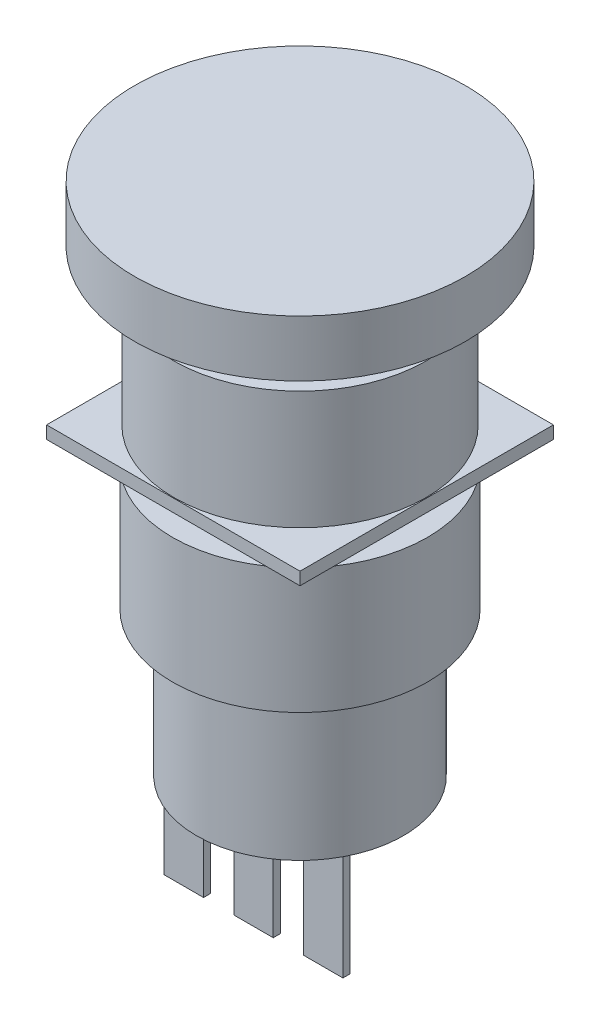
ISO-10303-21;
HEADER;
FILE_DESCRIPTION(('STEP AP214'),'2;1');
FILE_NAME('part.step','',(''),(''),'','','');
FILE_SCHEMA(('AUTOMOTIVE_DESIGN { 1 0 10303 214 1 1 1 1 }'));
ENDSEC;
DATA;
#1=APPLICATION_CONTEXT('core data for automotive mechanical design processes');
#2=APPLICATION_PROTOCOL_DEFINITION('international standard','automotive_design',2000,#1);
#3=PRODUCT_CONTEXT('',#1,'mechanical');
#4=PRODUCT('Part','Part','',(#3));
#5=PRODUCT_RELATED_PRODUCT_CATEGORY('part','',(#4));
#6=PRODUCT_DEFINITION_FORMATION('','',#4);
#7=PRODUCT_DEFINITION_CONTEXT('part definition',#1,'design');
#8=PRODUCT_DEFINITION('design','',#6,#7);
#9=PRODUCT_DEFINITION_SHAPE('','',#8);
#10=(LENGTH_UNIT() NAMED_UNIT(*) SI_UNIT(.MILLI.,.METRE.));
#11=(NAMED_UNIT(*) PLANE_ANGLE_UNIT() SI_UNIT($,.RADIAN.));
#12=(NAMED_UNIT(*) SI_UNIT($,.STERADIAN.) SOLID_ANGLE_UNIT());
#13=UNCERTAINTY_MEASURE_WITH_UNIT(LENGTH_MEASURE(1.E-05),#10,'distance_accuracy_value','');
#14=(GEOMETRIC_REPRESENTATION_CONTEXT(3) GLOBAL_UNCERTAINTY_ASSIGNED_CONTEXT((#13)) GLOBAL_UNIT_ASSIGNED_CONTEXT((#10,
#11,#12)) REPRESENTATION_CONTEXT('',''));
#15=CARTESIAN_POINT('',(0.,0.,0.));
#16=DIRECTION('',(0.,0.,1.));
#17=DIRECTION('',(1.,0.,0.));
#18=AXIS2_PLACEMENT_3D('',#15,#16,#17);
#19=CARTESIAN_POINT('',(-7.45,-10.8,0.));
#20=DIRECTION('',(0.,1.,0.));
#21=DIRECTION('',(0.,0.,1.));
#22=AXIS2_PLACEMENT_3D('',#19,#20,#21);
#23=PLANE('',#22);
#24=CARTESIAN_POINT('',(0.,-10.8,0.));
#25=DIRECTION('',(0.,1.,0.));
#26=DIRECTION('',(0.,0.,1.));
#27=AXIS2_PLACEMENT_3D('',#24,#25,#26);
#28=CIRCLE('',#27,9.05);
#29=CARTESIAN_POINT('',(0.,-10.8,9.05));
#30=VERTEX_POINT('',#29);
#31=EDGE_CURVE('E11',#30,#30,#28,.T.);
#32=ORIENTED_EDGE('',*,*,#31,.T.);
#33=EDGE_LOOP('',(#32));
#34=FACE_BOUND('',#33,.T.);
#35=CARTESIAN_POINT('',(0.,-10.8,0.));
#36=DIRECTION('',(0.,1.,0.));
#37=DIRECTION('',(0.,0.,1.));
#38=AXIS2_PLACEMENT_3D('',#35,#36,#37);
#39=CIRCLE('',#38,7.45);
#40=CARTESIAN_POINT('',(0.,-10.8,7.45));
#41=VERTEX_POINT('',#40);
#42=EDGE_CURVE('E61',#41,#41,#39,.T.);
#43=ORIENTED_EDGE('',*,*,#42,.F.);
#44=EDGE_LOOP('',(#43));
#45=FACE_BOUND('',#44,.T.);
#46=ADVANCED_FACE('F47',(#34,#45),#23,.T.);
#47=CARTESIAN_POINT('',(0.,0.,0.));
#48=DIRECTION('',(0.,1.,0.));
#49=DIRECTION('',(0.,0.,1.));
#50=AXIS2_PLACEMENT_3D('',#47,#48,#49);
#51=CYLINDRICAL_SURFACE('',#50,9.05);
#52=CARTESIAN_POINT('',(0.,-19.7,0.));
#53=DIRECTION('',(0.,1.,0.));
#54=DIRECTION('',(0.,0.,1.));
#55=AXIS2_PLACEMENT_3D('',#52,#53,#54);
#56=CIRCLE('',#55,9.05);
#57=CARTESIAN_POINT('',(0.,-19.7,9.05));
#58=VERTEX_POINT('',#57);
#59=EDGE_CURVE('E53',#58,#58,#56,.T.);
#60=ORIENTED_EDGE('',*,*,#59,.T.);
#61=EDGE_LOOP('',(#60));
#62=FACE_BOUND('',#61,.T.);
#63=ORIENTED_EDGE('',*,*,#31,.F.);
#64=EDGE_LOOP('',(#63));
#65=FACE_BOUND('',#64,.T.);
#66=ADVANCED_FACE('F71',(#62,#65),#51,.T.);
#67=CARTESIAN_POINT('',(-9.05,-19.7,0.));
#68=DIRECTION('',(0.,-1.,0.));
#69=DIRECTION('',(0.,0.,-1.));
#70=AXIS2_PLACEMENT_3D('',#67,#68,#69);
#71=PLANE('',#70);
#72=CARTESIAN_POINT('',(0.,-19.7,0.));
#73=DIRECTION('',(0.,1.,0.));
#74=DIRECTION('',(0.,0.,1.));
#75=AXIS2_PLACEMENT_3D('',#72,#73,#74);
#76=CIRCLE('',#75,7.45);
#77=CARTESIAN_POINT('',(0.,-19.7,7.45));
#78=VERTEX_POINT('',#77);
#79=EDGE_CURVE('E57',#78,#78,#76,.T.);
#80=ORIENTED_EDGE('',*,*,#79,.T.);
#81=EDGE_LOOP('',(#80));
#82=FACE_BOUND('',#81,.T.);
#83=ORIENTED_EDGE('',*,*,#59,.F.);
#84=EDGE_LOOP('',(#83));
#85=FACE_BOUND('',#84,.T.);
#86=ADVANCED_FACE('F75',(#82,#85),#71,.T.);
#87=CARTESIAN_POINT('',(0.,0.,0.));
#88=DIRECTION('',(0.,1.,0.));
#89=DIRECTION('',(0.,0.,1.));
#90=AXIS2_PLACEMENT_3D('',#87,#88,#89);
#91=CYLINDRICAL_SURFACE('',#90,7.45);
#92=ORIENTED_EDGE('',*,*,#42,.T.);
#93=EDGE_LOOP('',(#92));
#94=FACE_BOUND('',#93,.T.);
#95=ORIENTED_EDGE('',*,*,#79,.F.);
#96=EDGE_LOOP('',(#95));
#97=FACE_BOUND('',#96,.T.);
#98=ADVANCED_FACE('F67',(#94,#97),#91,.F.);
#99=CLOSED_SHELL('',(#46,#66,#86,#98));
#100=MANIFOLD_SOLID_BREP('B2',#99);
#101=CARTESIAN_POINT('',(0.,0.,0.));
#102=DIRECTION('',(0.,1.,0.));
#103=DIRECTION('',(0.,0.,1.));
#104=AXIS2_PLACEMENT_3D('',#101,#102,#103);
#105=PLANE('',#104);
#106=CARTESIAN_POINT('',(0.,0.,0.));
#107=DIRECTION('',(0.,1.,0.));
#108=DIRECTION('',(0.,0.,1.));
#109=AXIS2_PLACEMENT_3D('',#106,#107,#108);
#110=CIRCLE('',#109,7.8);
#111=CARTESIAN_POINT('',(0.,0.,7.8));
#112=VERTEX_POINT('',#111);
#113=EDGE_CURVE('E120',#112,#112,#110,.F.);
#114=ORIENTED_EDGE('',*,*,#113,.T.);
#115=EDGE_LOOP('',(#114));
#116=FACE_BOUND('',#115,.T.);
#117=CARTESIAN_POINT('',(0.,0.,0.));
#118=DIRECTION('',(0.,1.,0.));
#119=DIRECTION('',(0.,0.,1.));
#120=AXIS2_PLACEMENT_3D('',#117,#118,#119);
#121=CIRCLE('',#120,8.95);
#122=CARTESIAN_POINT('',(0.,0.,8.95));
#123=VERTEX_POINT('',#122);
#124=EDGE_CURVE('E125',#123,#123,#121,.T.);
#125=ORIENTED_EDGE('',*,*,#124,.T.);
#126=EDGE_LOOP('',(#125));
#127=FACE_BOUND('',#126,.T.);
#128=ADVANCED_FACE('F117',(#116,#127),#105,.T.);
#129=CARTESIAN_POINT('',(0.,0.,0.));
#130=DIRECTION('',(0.,1.,0.));
#131=DIRECTION('',(0.,0.,1.));
#132=AXIS2_PLACEMENT_3D('',#129,#130,#131);
#133=CYLINDRICAL_SURFACE('',#132,8.95);
#134=CARTESIAN_POINT('',(0.,-8.4,0.));
#135=DIRECTION('',(0.,-1.,0.));
#136=DIRECTION('',(0.,0.,-1.));
#137=AXIS2_PLACEMENT_3D('',#134,#135,#136);
#138=CIRCLE('',#137,8.95);
#139=CARTESIAN_POINT('',(0.,-8.4,-8.95));
#140=VERTEX_POINT('',#139);
#141=EDGE_CURVE('E367',#140,#140,#138,.F.);
#142=ORIENTED_EDGE('',*,*,#141,.T.);
#143=EDGE_LOOP('',(#142));
#144=FACE_BOUND('',#143,.T.);
#145=ORIENTED_EDGE('',*,*,#124,.F.);
#146=EDGE_LOOP('',(#145));
#147=FACE_BOUND('',#146,.T.);
#148=ADVANCED_FACE('F377',(#144,#147),#133,.T.);
#149=CARTESIAN_POINT('',(-9.,-9.3,-9.));
#150=DIRECTION('',(1.,0.,0.));
#151=DIRECTION('',(0.,0.,-1.));
#152=AXIS2_PLACEMENT_3D('',#149,#150,#151);
#153=PLANE('',#152);
#154=DIRECTION('',(0.,0.,-1.));
#155=VECTOR('',#154,1.);
#156=CARTESIAN_POINT('',(-9.,-8.4,-9.));
#157=LINE('',#156,#155);
#158=CARTESIAN_POINT('',(-9.,-8.4,9.));
#159=VERTEX_POINT('',#158);
#160=CARTESIAN_POINT('',(-9.,-8.4,-9.));
#161=VERTEX_POINT('',#160);
#162=EDGE_CURVE('E348',#159,#161,#157,.T.);
#163=ORIENTED_EDGE('',*,*,#162,.T.);
#164=DIRECTION('',(0.,1.,0.));
#165=VECTOR('',#164,1.);
#166=CARTESIAN_POINT('',(-9.,-9.3,-9.));
#167=LINE('',#166,#165);
#168=CARTESIAN_POINT('',(-9.,-9.3,-9.));
#169=VERTEX_POINT('',#168);
#170=EDGE_CURVE('E364',#169,#161,#167,.T.);
#171=ORIENTED_EDGE('',*,*,#170,.F.);
#172=DIRECTION('',(0.,0.,-1.));
#173=VECTOR('',#172,1.);
#174=CARTESIAN_POINT('',(-9.,-9.3,-9.));
#175=LINE('',#174,#173);
#176=CARTESIAN_POINT('',(-9.,-9.3,9.));
#177=VERTEX_POINT('',#176);
#178=EDGE_CURVE('E337',#177,#169,#175,.T.);
#179=ORIENTED_EDGE('',*,*,#178,.F.);
#180=DIRECTION('',(0.,1.,0.));
#181=VECTOR('',#180,1.);
#182=CARTESIAN_POINT('',(-9.,-9.3,9.));
#183=LINE('',#182,#181);
#184=EDGE_CURVE('E347',#177,#159,#183,.T.);
#185=ORIENTED_EDGE('',*,*,#184,.T.);
#186=EDGE_LOOP('',(#163,#171,#179,#185));
#187=FACE_BOUND('',#186,.T.);
#188=ADVANCED_FACE('F379',(#187),#153,.F.);
#189=CARTESIAN_POINT('',(9.,-9.3,-9.));
#190=DIRECTION('',(0.,0.,1.));
#191=DIRECTION('',(1.,0.,0.));
#192=AXIS2_PLACEMENT_3D('',#189,#190,#191);
#193=PLANE('',#192);
#194=DIRECTION('',(1.,0.,0.));
#195=VECTOR('',#194,1.);
#196=CARTESIAN_POINT('',(9.,-8.4,-9.));
#197=LINE('',#196,#195);
#198=CARTESIAN_POINT('',(9.,-8.4,-9.));
#199=VERTEX_POINT('',#198);
#200=EDGE_CURVE('E351',#161,#199,#197,.T.);
#201=ORIENTED_EDGE('',*,*,#200,.T.);
#202=DIRECTION('',(0.,1.,0.));
#203=VECTOR('',#202,1.);
#204=CARTESIAN_POINT('',(9.,-9.3,-9.));
#205=LINE('',#204,#203);
#206=CARTESIAN_POINT('',(9.,-9.3,-9.));
#207=VERTEX_POINT('',#206);
#208=EDGE_CURVE('E361',#207,#199,#205,.T.);
#209=ORIENTED_EDGE('',*,*,#208,.F.);
#210=DIRECTION('',(1.,0.,0.));
#211=VECTOR('',#210,1.);
#212=CARTESIAN_POINT('',(9.,-9.3,-9.));
#213=LINE('',#212,#211);
#214=EDGE_CURVE('E340',#169,#207,#213,.T.);
#215=ORIENTED_EDGE('',*,*,#214,.F.);
#216=ORIENTED_EDGE('',*,*,#170,.T.);
#217=EDGE_LOOP('',(#201,#209,#215,#216));
#218=FACE_BOUND('',#217,.T.);
#219=ADVANCED_FACE('F385',(#218),#193,.F.);
#220=CARTESIAN_POINT('',(9.,-9.3,-9.));
#221=DIRECTION('',(-1.,0.,0.));
#222=DIRECTION('',(0.,0.,1.));
#223=AXIS2_PLACEMENT_3D('',#220,#221,#222);
#224=PLANE('',#223);
#225=DIRECTION('',(0.,0.,1.));
#226=VECTOR('',#225,1.);
#227=CARTESIAN_POINT('',(9.,-8.4,-9.));
#228=LINE('',#227,#226);
#229=CARTESIAN_POINT('',(9.,-8.4,9.));
#230=VERTEX_POINT('',#229);
#231=EDGE_CURVE('E353',#199,#230,#228,.T.);
#232=ORIENTED_EDGE('',*,*,#231,.T.);
#233=DIRECTION('',(0.,1.,0.));
#234=VECTOR('',#233,1.);
#235=CARTESIAN_POINT('',(9.,-9.3,9.));
#236=LINE('',#235,#234);
#237=CARTESIAN_POINT('',(9.,-9.3,9.));
#238=VERTEX_POINT('',#237);
#239=EDGE_CURVE('E358',#238,#230,#236,.T.);
#240=ORIENTED_EDGE('',*,*,#239,.F.);
#241=DIRECTION('',(0.,0.,1.));
#242=VECTOR('',#241,1.);
#243=CARTESIAN_POINT('',(9.,-9.3,-9.));
#244=LINE('',#243,#242);
#245=EDGE_CURVE('E343',#207,#238,#244,.T.);
#246=ORIENTED_EDGE('',*,*,#245,.F.);
#247=ORIENTED_EDGE('',*,*,#208,.T.);
#248=EDGE_LOOP('',(#232,#240,#246,#247));
#249=FACE_BOUND('',#248,.T.);
#250=ADVANCED_FACE('F400',(#249),#224,.F.);
#251=CARTESIAN_POINT('',(9.,-9.3,9.));
#252=DIRECTION('',(0.,0.,-1.));
#253=DIRECTION('',(-1.,0.,0.));
#254=AXIS2_PLACEMENT_3D('',#251,#252,#253);
#255=PLANE('',#254);
#256=DIRECTION('',(-1.,0.,0.));
#257=VECTOR('',#256,1.);
#258=CARTESIAN_POINT('',(9.,-8.4,9.));
#259=LINE('',#258,#257);
#260=EDGE_CURVE('E341',#230,#159,#259,.T.);
#261=ORIENTED_EDGE('',*,*,#260,.T.);
#262=ORIENTED_EDGE('',*,*,#184,.F.);
#263=DIRECTION('',(-1.,0.,0.));
#264=VECTOR('',#263,1.);
#265=CARTESIAN_POINT('',(9.,-9.3,9.));
#266=LINE('',#265,#264);
#267=EDGE_CURVE('E345',#238,#177,#266,.T.);
#268=ORIENTED_EDGE('',*,*,#267,.F.);
#269=ORIENTED_EDGE('',*,*,#239,.T.);
#270=EDGE_LOOP('',(#261,#262,#268,#269));
#271=FACE_BOUND('',#270,.T.);
#272=ADVANCED_FACE('F404',(#271),#255,.F.);
#273=CARTESIAN_POINT('',(0.,-9.3,0.));
#274=DIRECTION('',(0.,-1.,0.));
#275=DIRECTION('',(0.,0.,-1.));
#276=AXIS2_PLACEMENT_3D('',#273,#274,#275);
#277=PLANE('',#276);
#278=CARTESIAN_POINT('',(0.,-9.3,0.));
#279=DIRECTION('',(0.,-1.,0.));
#280=DIRECTION('',(0.,0.,-1.));
#281=AXIS2_PLACEMENT_3D('',#278,#279,#280);
#282=CIRCLE('',#281,7.35);
#283=CARTESIAN_POINT('',(0.,-9.3,-7.35));
#284=VERTEX_POINT('',#283);
#285=EDGE_CURVE('E45',#284,#284,#282,.F.);
#286=ORIENTED_EDGE('',*,*,#285,.T.);
#287=EDGE_LOOP('',(#286));
#288=FACE_BOUND('',#287,.T.);
#289=ORIENTED_EDGE('',*,*,#178,.T.);
#290=ORIENTED_EDGE('',*,*,#214,.T.);
#291=ORIENTED_EDGE('',*,*,#245,.T.);
#292=ORIENTED_EDGE('',*,*,#267,.T.);
#293=EDGE_LOOP('',(#289,#290,#291,#292));
#294=FACE_BOUND('',#293,.T.);
#295=ADVANCED_FACE('F408',(#288,#294),#277,.T.);
#296=CARTESIAN_POINT('',(0.,-8.4,0.));
#297=DIRECTION('',(0.,-1.,0.));
#298=DIRECTION('',(0.,0.,-1.));
#299=AXIS2_PLACEMENT_3D('',#296,#297,#298);
#300=PLANE('',#299);
#301=ORIENTED_EDGE('',*,*,#141,.F.);
#302=EDGE_LOOP('',(#301));
#303=FACE_BOUND('',#302,.T.);
#304=ORIENTED_EDGE('',*,*,#162,.F.);
#305=ORIENTED_EDGE('',*,*,#260,.F.);
#306=ORIENTED_EDGE('',*,*,#231,.F.);
#307=ORIENTED_EDGE('',*,*,#200,.F.);
#308=EDGE_LOOP('',(#304,#305,#306,#307));
#309=FACE_BOUND('',#308,.T.);
#310=ADVANCED_FACE('F396',(#303,#309),#300,.F.);
#311=CARTESIAN_POINT('',(-7.35,-30.,0.));
#312=DIRECTION('',(0.,-1.,0.));
#313=DIRECTION('',(0.,0.,-1.));
#314=AXIS2_PLACEMENT_3D('',#311,#312,#313);
#315=PLANE('',#314);
#316=DIRECTION('',(-1.,0.,0.));
#317=VECTOR('',#316,1.);
#318=CARTESIAN_POINT('',(3.55,-30.,3.3));
#319=LINE('',#318,#317);
#320=CARTESIAN_POINT('',(6.35,-30.,3.3));
#321=VERTEX_POINT('',#320);
#322=CARTESIAN_POINT('',(3.55,-30.,3.3));
#323=VERTEX_POINT('',#322);
#324=EDGE_CURVE('E252',#321,#323,#319,.T.);
#325=ORIENTED_EDGE('',*,*,#324,.F.);
#326=DIRECTION('',(0.,0.,-1.));
#327=VECTOR('',#326,1.);
#328=CARTESIAN_POINT('',(6.35,-30.,3.3));
#329=LINE('',#328,#327);
#330=CARTESIAN_POINT('',(6.35,-30.,2.8));
#331=VERTEX_POINT('',#330);
#332=EDGE_CURVE('E237',#321,#331,#329,.T.);
#333=ORIENTED_EDGE('',*,*,#332,.T.);
#334=DIRECTION('',(-1.,0.,0.));
#335=VECTOR('',#334,1.);
#336=CARTESIAN_POINT('',(3.55,-30.,2.8));
#337=LINE('',#336,#335);
#338=CARTESIAN_POINT('',(3.55,-30.,2.8));
#339=VERTEX_POINT('',#338);
#340=EDGE_CURVE('E242',#331,#339,#337,.T.);
#341=ORIENTED_EDGE('',*,*,#340,.T.);
#342=DIRECTION('',(0.,0.,-1.));
#343=VECTOR('',#342,1.);
#344=CARTESIAN_POINT('',(3.55,-30.,3.3));
#345=LINE('',#344,#343);
#346=EDGE_CURVE('E253',#323,#339,#345,.T.);
#347=ORIENTED_EDGE('',*,*,#346,.F.);
#348=EDGE_LOOP('',(#325,#333,#341,#347));
#349=FACE_BOUND('',#348,.T.);
#350=DIRECTION('',(-1.,0.,0.));
#351=VECTOR('',#350,1.);
#352=CARTESIAN_POINT('',(-1.4,-30.,3.3));
#353=LINE('',#352,#351);
#354=CARTESIAN_POINT('',(1.4,-30.,3.3));
#355=VERTEX_POINT('',#354);
#356=CARTESIAN_POINT('',(-1.4,-30.,3.3));
#357=VERTEX_POINT('',#356);
#358=EDGE_CURVE('E280',#355,#357,#353,.T.);
#359=ORIENTED_EDGE('',*,*,#358,.F.);
#360=DIRECTION('',(0.,0.,-1.));
#361=VECTOR('',#360,1.);
#362=CARTESIAN_POINT('',(1.4,-30.,3.3));
#363=LINE('',#362,#361);
#364=CARTESIAN_POINT('',(1.4,-30.,2.8));
#365=VERTEX_POINT('',#364);
#366=EDGE_CURVE('E275',#355,#365,#363,.T.);
#367=ORIENTED_EDGE('',*,*,#366,.T.);
#368=DIRECTION('',(-1.,0.,0.));
#369=VECTOR('',#368,1.);
#370=CARTESIAN_POINT('',(-1.4,-30.,2.8));
#371=LINE('',#370,#369);
#372=CARTESIAN_POINT('',(-1.4,-30.,2.8));
#373=VERTEX_POINT('',#372);
#374=EDGE_CURVE('E281',#365,#373,#371,.T.);
#375=ORIENTED_EDGE('',*,*,#374,.T.);
#376=DIRECTION('',(0.,0.,-1.));
#377=VECTOR('',#376,1.);
#378=CARTESIAN_POINT('',(-1.4,-30.,3.3));
#379=LINE('',#378,#377);
#380=EDGE_CURVE('E278',#357,#373,#379,.T.);
#381=ORIENTED_EDGE('',*,*,#380,.F.);
#382=EDGE_LOOP('',(#359,#367,#375,#381));
#383=FACE_BOUND('',#382,.T.);
#384=DIRECTION('',(-1.,0.,0.));
#385=VECTOR('',#384,1.);
#386=CARTESIAN_POINT('',(-6.35,-30.,3.3));
#387=LINE('',#386,#385);
#388=CARTESIAN_POINT('',(-3.55,-30.,3.3));
#389=VERTEX_POINT('',#388);
#390=CARTESIAN_POINT('',(-6.35,-30.,3.3));
#391=VERTEX_POINT('',#390);
#392=EDGE_CURVE('E306',#389,#391,#387,.T.);
#393=ORIENTED_EDGE('',*,*,#392,.F.);
#394=DIRECTION('',(0.,0.,-1.));
#395=VECTOR('',#394,1.);
#396=CARTESIAN_POINT('',(-3.55,-30.,3.3));
#397=LINE('',#396,#395);
#398=CARTESIAN_POINT('',(-3.55,-30.,2.8));
#399=VERTEX_POINT('',#398);
#400=EDGE_CURVE('E319',#389,#399,#397,.T.);
#401=ORIENTED_EDGE('',*,*,#400,.T.);
#402=DIRECTION('',(-1.,0.,0.));
#403=VECTOR('',#402,1.);
#404=CARTESIAN_POINT('',(-6.35,-30.,2.8));
#405=LINE('',#404,#403);
#406=CARTESIAN_POINT('',(-6.35,-30.,2.8));
#407=VERTEX_POINT('',#406);
#408=EDGE_CURVE('E302',#399,#407,#405,.T.);
#409=ORIENTED_EDGE('',*,*,#408,.T.);
#410=DIRECTION('',(0.,0.,-1.));
#411=VECTOR('',#410,1.);
#412=CARTESIAN_POINT('',(-6.35,-30.,3.3));
#413=LINE('',#412,#411);
#414=EDGE_CURVE('E308',#391,#407,#413,.T.);
#415=ORIENTED_EDGE('',*,*,#414,.F.);
#416=EDGE_LOOP('',(#393,#401,#409,#415));
#417=FACE_BOUND('',#416,.T.);
#418=CARTESIAN_POINT('',(0.,-30.,0.));
#419=DIRECTION('',(0.,1.,0.));
#420=DIRECTION('',(0.,0.,1.));
#421=AXIS2_PLACEMENT_3D('',#418,#419,#420);
#422=CIRCLE('',#421,7.35);
#423=CARTESIAN_POINT('',(0.,-30.,7.35));
#424=VERTEX_POINT('',#423);
#425=EDGE_CURVE('E370',#424,#424,#422,.T.);
#426=ORIENTED_EDGE('',*,*,#425,.F.);
#427=EDGE_LOOP('',(#426));
#428=FACE_BOUND('',#427,.T.);
#429=ADVANCED_FACE('F250',(#349,#383,#417,#428),#315,.T.);
#430=CARTESIAN_POINT('',(0.,0.,0.));
#431=DIRECTION('',(0.,1.,0.));
#432=DIRECTION('',(0.,0.,1.));
#433=AXIS2_PLACEMENT_3D('',#430,#431,#432);
#434=CYLINDRICAL_SURFACE('',#433,7.35);
#435=ORIENTED_EDGE('',*,*,#285,.F.);
#436=EDGE_LOOP('',(#435));
#437=FACE_BOUND('',#436,.T.);
#438=ORIENTED_EDGE('',*,*,#425,.T.);
#439=EDGE_LOOP('',(#438));
#440=FACE_BOUND('',#439,.T.);
#441=ADVANCED_FACE('F390',(#437,#440),#434,.T.);
#442=CARTESIAN_POINT('',(-11.75,6.6,0.));
#443=DIRECTION('',(0.,-1.,0.));
#444=DIRECTION('',(1.,0.,0.));
#445=AXIS2_PLACEMENT_3D('',#442,#443,#444);
#446=PLANE('',#445);
#447=CARTESIAN_POINT('',(0.,6.6,0.));
#448=DIRECTION('',(0.,-1.,0.));
#449=DIRECTION('',(1.,0.,0.));
#450=AXIS2_PLACEMENT_3D('',#447,#448,#449);
#451=CIRCLE('',#450,11.75);
#452=CARTESIAN_POINT('',(11.75,6.60000000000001,0.));
#453=VERTEX_POINT('',#452);
#454=EDGE_CURVE('E334',#453,#453,#451,.T.);
#455=ORIENTED_EDGE('',*,*,#454,.F.);
#456=EDGE_LOOP('',(#455));
#457=FACE_BOUND('',#456,.T.);
#458=ADVANCED_FACE('F393',(#457),#446,.F.);
#459=CARTESIAN_POINT('',(0.,-3.8,0.));
#460=DIRECTION('',(0.,-1.,0.));
#461=DIRECTION('',(1.,0.,0.));
#462=AXIS2_PLACEMENT_3D('',#459,#460,#461);
#463=CYLINDRICAL_SURFACE('',#462,11.75);
#464=CARTESIAN_POINT('',(0.,2.6,0.));
#465=DIRECTION('',(0.,-1.,0.));
#466=DIRECTION('',(1.,0.,0.));
#467=AXIS2_PLACEMENT_3D('',#464,#465,#466);
#468=CIRCLE('',#467,11.75);
#469=CARTESIAN_POINT('',(11.75,2.60000000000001,0.));
#470=VERTEX_POINT('',#469);
#471=EDGE_CURVE('E331',#470,#470,#468,.T.);
#472=ORIENTED_EDGE('',*,*,#471,.F.);
#473=EDGE_LOOP('',(#472));
#474=FACE_BOUND('',#473,.T.);
#475=ORIENTED_EDGE('',*,*,#454,.T.);
#476=EDGE_LOOP('',(#475));
#477=FACE_BOUND('',#476,.T.);
#478=ADVANCED_FACE('F418',(#474,#477),#463,.T.);
#479=CARTESIAN_POINT('',(-11.75,2.6,0.));
#480=DIRECTION('',(0.,1.,0.));
#481=DIRECTION('',(-1.,0.,0.));
#482=AXIS2_PLACEMENT_3D('',#479,#480,#481);
#483=PLANE('',#482);
#484=CARTESIAN_POINT('',(0.,2.6,0.));
#485=DIRECTION('',(0.,-1.,0.));
#486=DIRECTION('',(1.,0.,0.));
#487=AXIS2_PLACEMENT_3D('',#484,#485,#486);
#488=CIRCLE('',#487,7.8);
#489=CARTESIAN_POINT('',(7.8,2.6,0.));
#490=VERTEX_POINT('',#489);
#491=EDGE_CURVE('E328',#490,#490,#488,.T.);
#492=ORIENTED_EDGE('',*,*,#491,.F.);
#493=EDGE_LOOP('',(#492));
#494=FACE_BOUND('',#493,.T.);
#495=ORIENTED_EDGE('',*,*,#471,.T.);
#496=EDGE_LOOP('',(#495));
#497=FACE_BOUND('',#496,.T.);
#498=ADVANCED_FACE('F422',(#494,#497),#483,.F.);
#499=CARTESIAN_POINT('',(0.,-3.8,0.));
#500=DIRECTION('',(0.,-1.,0.));
#501=DIRECTION('',(1.,0.,0.));
#502=AXIS2_PLACEMENT_3D('',#499,#500,#501);
#503=CYLINDRICAL_SURFACE('',#502,7.8);
#504=ORIENTED_EDGE('',*,*,#113,.F.);
#505=EDGE_LOOP('',(#504));
#506=FACE_BOUND('',#505,.T.);
#507=ORIENTED_EDGE('',*,*,#491,.T.);
#508=EDGE_LOOP('',(#507));
#509=FACE_BOUND('',#508,.T.);
#510=ADVANCED_FACE('F426',(#506,#509),#503,.T.);
#511=CARTESIAN_POINT('',(-6.35,-30.,3.3));
#512=DIRECTION('',(1.,0.,0.));
#513=DIRECTION('',(0.,1.,0.));
#514=AXIS2_PLACEMENT_3D('',#511,#512,#513);
#515=PLANE('',#514);
#516=DIRECTION('',(0.,-1.,0.));
#517=VECTOR('',#516,1.);
#518=CARTESIAN_POINT('',(-6.35,-30.,2.8));
#519=LINE('',#518,#517);
#520=CARTESIAN_POINT('',(-6.35,-37.6,2.8));
#521=VERTEX_POINT('',#520);
#522=EDGE_CURVE('E290',#407,#521,#519,.T.);
#523=ORIENTED_EDGE('',*,*,#522,.T.);
#524=DIRECTION('',(0.,0.,-1.));
#525=VECTOR('',#524,1.);
#526=CARTESIAN_POINT('',(-6.35,-37.6,3.3));
#527=LINE('',#526,#525);
#528=CARTESIAN_POINT('',(-6.35,-37.6,3.3));
#529=VERTEX_POINT('',#528);
#530=EDGE_CURVE('E325',#529,#521,#527,.T.);
#531=ORIENTED_EDGE('',*,*,#530,.F.);
#532=DIRECTION('',(0.,-1.,0.));
#533=VECTOR('',#532,1.);
#534=CARTESIAN_POINT('',(-6.35,-30.,3.3));
#535=LINE('',#534,#533);
#536=EDGE_CURVE('E298',#391,#529,#535,.T.);
#537=ORIENTED_EDGE('',*,*,#536,.F.);
#538=ORIENTED_EDGE('',*,*,#414,.T.);
#539=EDGE_LOOP('',(#523,#531,#537,#538));
#540=FACE_BOUND('',#539,.T.);
#541=ADVANCED_FACE('F430',(#540),#515,.F.);
#542=CARTESIAN_POINT('',(-6.35,-37.6,3.3));
#543=DIRECTION('',(0.,1.,0.));
#544=DIRECTION('',(0.,0.,1.));
#545=AXIS2_PLACEMENT_3D('',#542,#543,#544);
#546=PLANE('',#545);
#547=DIRECTION('',(1.,0.,0.));
#548=VECTOR('',#547,1.);
#549=CARTESIAN_POINT('',(-6.35,-37.6,2.8));
#550=LINE('',#549,#548);
#551=CARTESIAN_POINT('',(-3.55,-37.6,2.8));
#552=VERTEX_POINT('',#551);
#553=EDGE_CURVE('E311',#521,#552,#550,.T.);
#554=ORIENTED_EDGE('',*,*,#553,.T.);
#555=DIRECTION('',(0.,0.,-1.));
#556=VECTOR('',#555,1.);
#557=CARTESIAN_POINT('',(-3.55,-37.6,3.3));
#558=LINE('',#557,#556);
#559=CARTESIAN_POINT('',(-3.55,-37.6,3.3));
#560=VERTEX_POINT('',#559);
#561=EDGE_CURVE('E322',#560,#552,#558,.T.);
#562=ORIENTED_EDGE('',*,*,#561,.F.);
#563=DIRECTION('',(1.,0.,0.));
#564=VECTOR('',#563,1.);
#565=CARTESIAN_POINT('',(-6.35,-37.6,3.3));
#566=LINE('',#565,#564);
#567=EDGE_CURVE('E301',#529,#560,#566,.T.);
#568=ORIENTED_EDGE('',*,*,#567,.F.);
#569=ORIENTED_EDGE('',*,*,#530,.T.);
#570=EDGE_LOOP('',(#554,#562,#568,#569));
#571=FACE_BOUND('',#570,.T.);
#572=ADVANCED_FACE('F434',(#571),#546,.F.);
#573=CARTESIAN_POINT('',(-3.55,-30.,3.3));
#574=DIRECTION('',(-1.,0.,0.));
#575=DIRECTION('',(0.,-1.,0.));
#576=AXIS2_PLACEMENT_3D('',#573,#574,#575);
#577=PLANE('',#576);
#578=DIRECTION('',(0.,1.,0.));
#579=VECTOR('',#578,1.);
#580=CARTESIAN_POINT('',(-3.55,-30.,2.8));
#581=LINE('',#580,#579);
#582=EDGE_CURVE('E313',#552,#399,#581,.T.);
#583=ORIENTED_EDGE('',*,*,#582,.T.);
#584=ORIENTED_EDGE('',*,*,#400,.F.);
#585=DIRECTION('',(0.,1.,0.));
#586=VECTOR('',#585,1.);
#587=CARTESIAN_POINT('',(-3.55,-30.,3.3));
#588=LINE('',#587,#586);
#589=EDGE_CURVE('E304',#560,#389,#588,.T.);
#590=ORIENTED_EDGE('',*,*,#589,.F.);
#591=ORIENTED_EDGE('',*,*,#561,.T.);
#592=EDGE_LOOP('',(#583,#584,#590,#591));
#593=FACE_BOUND('',#592,.T.);
#594=ADVANCED_FACE('F438',(#593),#577,.F.);
#595=CARTESIAN_POINT('',(0.,0.,3.3));
#596=DIRECTION('',(0.,0.,1.));
#597=DIRECTION('',(1.,0.,0.));
#598=AXIS2_PLACEMENT_3D('',#595,#596,#597);
#599=PLANE('',#598);
#600=ORIENTED_EDGE('',*,*,#536,.T.);
#601=ORIENTED_EDGE('',*,*,#567,.T.);
#602=ORIENTED_EDGE('',*,*,#589,.T.);
#603=ORIENTED_EDGE('',*,*,#392,.T.);
#604=EDGE_LOOP('',(#600,#601,#602,#603));
#605=FACE_BOUND('',#604,.T.);
#606=ADVANCED_FACE('F442',(#605),#599,.T.);
#607=CARTESIAN_POINT('',(0.,0.,2.8));
#608=DIRECTION('',(0.,0.,1.));
#609=DIRECTION('',(1.,0.,0.));
#610=AXIS2_PLACEMENT_3D('',#607,#608,#609);
#611=PLANE('',#610);
#612=ORIENTED_EDGE('',*,*,#522,.F.);
#613=ORIENTED_EDGE('',*,*,#408,.F.);
#614=ORIENTED_EDGE('',*,*,#582,.F.);
#615=ORIENTED_EDGE('',*,*,#553,.F.);
#616=EDGE_LOOP('',(#612,#613,#614,#615));
#617=FACE_BOUND('',#616,.T.);
#618=ADVANCED_FACE('F444',(#617),#611,.F.);
#619=CARTESIAN_POINT('',(-1.4,-30.,3.3));
#620=DIRECTION('',(1.,0.,0.));
#621=DIRECTION('',(0.,1.,0.));
#622=AXIS2_PLACEMENT_3D('',#619,#620,#621);
#623=PLANE('',#622);
#624=DIRECTION('',(0.,-1.,0.));
#625=VECTOR('',#624,1.);
#626=CARTESIAN_POINT('',(-1.4,-30.,2.8));
#627=LINE('',#626,#625);
#628=CARTESIAN_POINT('',(-1.4,-37.6,2.8));
#629=VERTEX_POINT('',#628);
#630=EDGE_CURVE('E140',#373,#629,#627,.T.);
#631=ORIENTED_EDGE('',*,*,#630,.T.);
#632=DIRECTION('',(0.,0.,-1.));
#633=VECTOR('',#632,1.);
#634=CARTESIAN_POINT('',(-1.4,-37.6,3.3));
#635=LINE('',#634,#633);
#636=CARTESIAN_POINT('',(-1.4,-37.6,3.3));
#637=VERTEX_POINT('',#636);
#638=EDGE_CURVE('E262',#637,#629,#635,.T.);
#639=ORIENTED_EDGE('',*,*,#638,.F.);
#640=DIRECTION('',(0.,-1.,0.));
#641=VECTOR('',#640,1.);
#642=CARTESIAN_POINT('',(-1.4,-30.,3.3));
#643=LINE('',#642,#641);
#644=EDGE_CURVE('E285',#357,#637,#643,.T.);
#645=ORIENTED_EDGE('',*,*,#644,.F.);
#646=ORIENTED_EDGE('',*,*,#380,.T.);
#647=EDGE_LOOP('',(#631,#639,#645,#646));
#648=FACE_BOUND('',#647,.T.);
#649=ADVANCED_FACE('F447',(#648),#623,.F.);
#650=CARTESIAN_POINT('',(-1.4,-37.6,3.3));
#651=DIRECTION('',(0.,1.,0.));
#652=DIRECTION('',(0.,0.,1.));
#653=AXIS2_PLACEMENT_3D('',#650,#651,#652);
#654=PLANE('',#653);
#655=DIRECTION('',(1.,0.,0.));
#656=VECTOR('',#655,1.);
#657=CARTESIAN_POINT('',(-1.4,-37.6,2.8));
#658=LINE('',#657,#656);
#659=CARTESIAN_POINT('',(1.4,-37.6,2.8));
#660=VERTEX_POINT('',#659);
#661=EDGE_CURVE('E287',#629,#660,#658,.T.);
#662=ORIENTED_EDGE('',*,*,#661,.T.);
#663=DIRECTION('',(0.,0.,-1.));
#664=VECTOR('',#663,1.);
#665=CARTESIAN_POINT('',(1.4,-37.6,3.3));
#666=LINE('',#665,#664);
#667=CARTESIAN_POINT('',(1.4,-37.6,3.3));
#668=VERTEX_POINT('',#667);
#669=EDGE_CURVE('E272',#668,#660,#666,.T.);
#670=ORIENTED_EDGE('',*,*,#669,.F.);
#671=DIRECTION('',(1.,0.,0.));
#672=VECTOR('',#671,1.);
#673=CARTESIAN_POINT('',(-1.4,-37.6,3.3));
#674=LINE('',#673,#672);
#675=EDGE_CURVE('E294',#637,#668,#674,.T.);
#676=ORIENTED_EDGE('',*,*,#675,.F.);
#677=ORIENTED_EDGE('',*,*,#638,.T.);
#678=EDGE_LOOP('',(#662,#670,#676,#677));
#679=FACE_BOUND('',#678,.T.);
#680=ADVANCED_FACE('F463',(#679),#654,.F.);
#681=CARTESIAN_POINT('',(1.4,-30.,3.3));
#682=DIRECTION('',(-1.,0.,0.));
#683=DIRECTION('',(0.,-1.,0.));
#684=AXIS2_PLACEMENT_3D('',#681,#682,#683);
#685=PLANE('',#684);
#686=DIRECTION('',(0.,1.,0.));
#687=VECTOR('',#686,1.);
#688=CARTESIAN_POINT('',(1.4,-30.,2.8));
#689=LINE('',#688,#687);
#690=EDGE_CURVE('E284',#660,#365,#689,.T.);
#691=ORIENTED_EDGE('',*,*,#690,.T.);
#692=ORIENTED_EDGE('',*,*,#366,.F.);
#693=DIRECTION('',(0.,1.,0.));
#694=VECTOR('',#693,1.);
#695=CARTESIAN_POINT('',(1.4,-30.,3.3));
#696=LINE('',#695,#694);
#697=EDGE_CURVE('E292',#668,#355,#696,.T.);
#698=ORIENTED_EDGE('',*,*,#697,.F.);
#699=ORIENTED_EDGE('',*,*,#669,.T.);
#700=EDGE_LOOP('',(#691,#692,#698,#699));
#701=FACE_BOUND('',#700,.T.);
#702=ADVANCED_FACE('F456',(#701),#685,.F.);
#703=CARTESIAN_POINT('',(0.,0.,3.3));
#704=DIRECTION('',(0.,0.,1.));
#705=DIRECTION('',(1.,0.,0.));
#706=AXIS2_PLACEMENT_3D('',#703,#704,#705);
#707=PLANE('',#706);
#708=ORIENTED_EDGE('',*,*,#644,.T.);
#709=ORIENTED_EDGE('',*,*,#675,.T.);
#710=ORIENTED_EDGE('',*,*,#697,.T.);
#711=ORIENTED_EDGE('',*,*,#358,.T.);
#712=EDGE_LOOP('',(#708,#709,#710,#711));
#713=FACE_BOUND('',#712,.T.);
#714=ADVANCED_FACE('F452',(#713),#707,.T.);
#715=CARTESIAN_POINT('',(0.,0.,2.8));
#716=DIRECTION('',(0.,0.,1.));
#717=DIRECTION('',(1.,0.,0.));
#718=AXIS2_PLACEMENT_3D('',#715,#716,#717);
#719=PLANE('',#718);
#720=ORIENTED_EDGE('',*,*,#630,.F.);
#721=ORIENTED_EDGE('',*,*,#374,.F.);
#722=ORIENTED_EDGE('',*,*,#690,.F.);
#723=ORIENTED_EDGE('',*,*,#661,.F.);
#724=EDGE_LOOP('',(#720,#721,#722,#723));
#725=FACE_BOUND('',#724,.T.);
#726=ADVANCED_FACE('F455',(#725),#719,.F.);
#727=CARTESIAN_POINT('',(3.55,-30.,3.3));
#728=DIRECTION('',(1.,0.,0.));
#729=DIRECTION('',(0.,1.,0.));
#730=AXIS2_PLACEMENT_3D('',#727,#728,#729);
#731=PLANE('',#730);
#732=DIRECTION('',(0.,-1.,0.));
#733=VECTOR('',#732,1.);
#734=CARTESIAN_POINT('',(3.55,-30.,2.8));
#735=LINE('',#734,#733);
#736=CARTESIAN_POINT('',(3.55,-37.6,2.8));
#737=VERTEX_POINT('',#736);
#738=EDGE_CURVE('E132',#339,#737,#735,.T.);
#739=ORIENTED_EDGE('',*,*,#738,.T.);
#740=DIRECTION('',(0.,0.,-1.));
#741=VECTOR('',#740,1.);
#742=CARTESIAN_POINT('',(3.55,-37.6,3.3));
#743=LINE('',#742,#741);
#744=CARTESIAN_POINT('',(3.55,-37.6,3.3));
#745=VERTEX_POINT('',#744);
#746=EDGE_CURVE('E256',#745,#737,#743,.T.);
#747=ORIENTED_EDGE('',*,*,#746,.F.);
#748=DIRECTION('',(0.,-1.,0.));
#749=VECTOR('',#748,1.);
#750=CARTESIAN_POINT('',(3.55,-30.,3.3));
#751=LINE('',#750,#749);
#752=EDGE_CURVE('E248',#323,#745,#751,.T.);
#753=ORIENTED_EDGE('',*,*,#752,.F.);
#754=ORIENTED_EDGE('',*,*,#346,.T.);
#755=EDGE_LOOP('',(#739,#747,#753,#754));
#756=FACE_BOUND('',#755,.T.);
#757=ADVANCED_FACE('F460',(#756),#731,.F.);
#758=CARTESIAN_POINT('',(3.55,-37.6,3.3));
#759=DIRECTION('',(0.,1.,0.));
#760=DIRECTION('',(0.,0.,1.));
#761=AXIS2_PLACEMENT_3D('',#758,#759,#760);
#762=PLANE('',#761);
#763=DIRECTION('',(1.,0.,0.));
#764=VECTOR('',#763,1.);
#765=CARTESIAN_POINT('',(3.55,-37.6,2.8));
#766=LINE('',#765,#764);
#767=CARTESIAN_POINT('',(6.35,-37.6,2.8));
#768=VERTEX_POINT('',#767);
#769=EDGE_CURVE('E241',#737,#768,#766,.T.);
#770=ORIENTED_EDGE('',*,*,#769,.T.);
#771=DIRECTION('',(0.,0.,-1.));
#772=VECTOR('',#771,1.);
#773=CARTESIAN_POINT('',(6.35,-37.6,3.3));
#774=LINE('',#773,#772);
#775=CARTESIAN_POINT('',(6.35,-37.6,3.3));
#776=VERTEX_POINT('',#775);
#777=EDGE_CURVE('E240',#776,#768,#774,.T.);
#778=ORIENTED_EDGE('',*,*,#777,.F.);
#779=DIRECTION('',(1.,0.,0.));
#780=VECTOR('',#779,1.);
#781=CARTESIAN_POINT('',(3.55,-37.6,3.3));
#782=LINE('',#781,#780);
#783=EDGE_CURVE('E266',#745,#776,#782,.T.);
#784=ORIENTED_EDGE('',*,*,#783,.F.);
#785=ORIENTED_EDGE('',*,*,#746,.T.);
#786=EDGE_LOOP('',(#770,#778,#784,#785));
#787=FACE_BOUND('',#786,.T.);
#788=ADVANCED_FACE('F479',(#787),#762,.F.);
#789=CARTESIAN_POINT('',(6.35,-30.,3.3));
#790=DIRECTION('',(-1.,0.,0.));
#791=DIRECTION('',(0.,-1.,0.));
#792=AXIS2_PLACEMENT_3D('',#789,#790,#791);
#793=PLANE('',#792);
#794=DIRECTION('',(0.,1.,0.));
#795=VECTOR('',#794,1.);
#796=CARTESIAN_POINT('',(6.35,-30.,2.8));
#797=LINE('',#796,#795);
#798=EDGE_CURVE('E233',#768,#331,#797,.T.);
#799=ORIENTED_EDGE('',*,*,#798,.T.);
#800=ORIENTED_EDGE('',*,*,#332,.F.);
#801=DIRECTION('',(0.,1.,0.));
#802=VECTOR('',#801,1.);
#803=CARTESIAN_POINT('',(6.35,-30.,3.3));
#804=LINE('',#803,#802);
#805=EDGE_CURVE('E264',#776,#321,#804,.T.);
#806=ORIENTED_EDGE('',*,*,#805,.F.);
#807=ORIENTED_EDGE('',*,*,#777,.T.);
#808=EDGE_LOOP('',(#799,#800,#806,#807));
#809=FACE_BOUND('',#808,.T.);
#810=ADVANCED_FACE('F234',(#809),#793,.F.);
#811=CARTESIAN_POINT('',(0.,0.,3.3));
#812=DIRECTION('',(0.,0.,1.));
#813=DIRECTION('',(1.,0.,0.));
#814=AXIS2_PLACEMENT_3D('',#811,#812,#813);
#815=PLANE('',#814);
#816=ORIENTED_EDGE('',*,*,#752,.T.);
#817=ORIENTED_EDGE('',*,*,#783,.T.);
#818=ORIENTED_EDGE('',*,*,#805,.T.);
#819=ORIENTED_EDGE('',*,*,#324,.T.);
#820=EDGE_LOOP('',(#816,#817,#818,#819));
#821=FACE_BOUND('',#820,.T.);
#822=ADVANCED_FACE('F471',(#821),#815,.T.);
#823=CARTESIAN_POINT('',(0.,0.,2.8));
#824=DIRECTION('',(0.,0.,1.));
#825=DIRECTION('',(1.,0.,0.));
#826=AXIS2_PLACEMENT_3D('',#823,#824,#825);
#827=PLANE('',#826);
#828=ORIENTED_EDGE('',*,*,#738,.F.);
#829=ORIENTED_EDGE('',*,*,#340,.F.);
#830=ORIENTED_EDGE('',*,*,#798,.F.);
#831=ORIENTED_EDGE('',*,*,#769,.F.);
#832=EDGE_LOOP('',(#828,#829,#830,#831));
#833=FACE_BOUND('',#832,.T.);
#834=ADVANCED_FACE('F245',(#833),#827,.F.);
#835=CLOSED_SHELL('',(#128,#148,#188,#219,#250,#272,#295,#310,#429,#441,#458,#478,#498,#510,
#541,#572,#594,#606,#618,#649,#680,#702,#714,#726,#757,#788,#810,#822,#834));
#836=MANIFOLD_SOLID_BREP('B6',#835);
#837=ADVANCED_BREP_SHAPE_REPRESENTATION('',(#18,#100,#836),#14);
#838=SHAPE_DEFINITION_REPRESENTATION(#9,#837);
ENDSEC;
END-ISO-10303-21;
